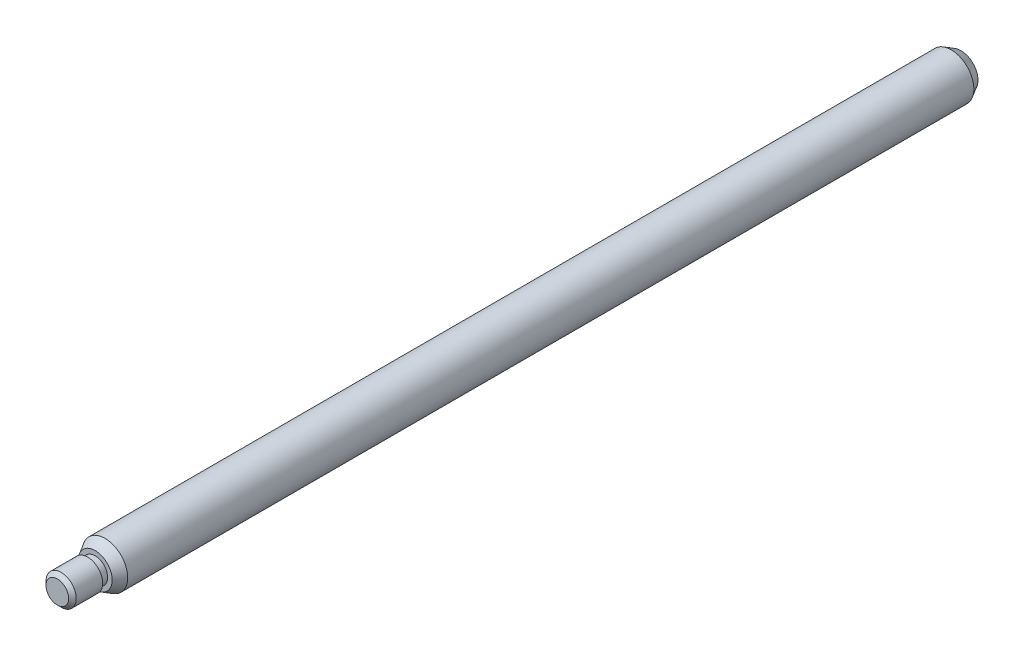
ISO-10303-21;
HEADER;
FILE_DESCRIPTION(('STEP AP214'),'2;1');
FILE_NAME('part.step','',(''),(''),'','','');
FILE_SCHEMA(('AUTOMOTIVE_DESIGN { 1 0 10303 214 1 1 1 1 }'));
ENDSEC;
DATA;
#1=APPLICATION_CONTEXT('core data for automotive mechanical design processes');
#2=APPLICATION_PROTOCOL_DEFINITION('international standard','automotive_design',2000,#1);
#3=PRODUCT_CONTEXT('',#1,'mechanical');
#4=PRODUCT('Part','Part','',(#3));
#5=PRODUCT_RELATED_PRODUCT_CATEGORY('part','',(#4));
#6=PRODUCT_DEFINITION_FORMATION('','',#4);
#7=PRODUCT_DEFINITION_CONTEXT('part definition',#1,'design');
#8=PRODUCT_DEFINITION('design','',#6,#7);
#9=PRODUCT_DEFINITION_SHAPE('','',#8);
#10=(LENGTH_UNIT() NAMED_UNIT(*) SI_UNIT(.MILLI.,.METRE.));
#11=(NAMED_UNIT(*) PLANE_ANGLE_UNIT() SI_UNIT($,.RADIAN.));
#12=(NAMED_UNIT(*) SI_UNIT($,.STERADIAN.) SOLID_ANGLE_UNIT());
#13=UNCERTAINTY_MEASURE_WITH_UNIT(LENGTH_MEASURE(1.E-05),#10,'distance_accuracy_value','');
#14=(GEOMETRIC_REPRESENTATION_CONTEXT(3) GLOBAL_UNCERTAINTY_ASSIGNED_CONTEXT((#13)) GLOBAL_UNIT_ASSIGNED_CONTEXT((#10,
#11,#12)) REPRESENTATION_CONTEXT('',''));
#15=CARTESIAN_POINT('',(0.,0.,0.));
#16=DIRECTION('',(0.,0.,1.));
#17=DIRECTION('',(1.,0.,0.));
#18=AXIS2_PLACEMENT_3D('',#15,#16,#17);
#19=CARTESIAN_POINT('',(0.,0.,114.5));
#20=DIRECTION('',(0.,0.,1.));
#21=DIRECTION('',(1.,0.,0.));
#22=AXIS2_PLACEMENT_3D('',#19,#20,#21);
#23=PLANE('',#22);
#24=CARTESIAN_POINT('',(0.,0.,114.5));
#25=DIRECTION('',(0.,0.,1.));
#26=DIRECTION('',(1.,0.,0.));
#27=AXIS2_PLACEMENT_3D('',#24,#25,#26);
#28=CIRCLE('',#27,2.24944465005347);
#29=CARTESIAN_POINT('',(-2.24944465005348,0.,114.5));
#30=VERTEX_POINT('',#29);
#31=EDGE_CURVE('E53',#30,#30,#28,.T.);
#32=ORIENTED_EDGE('',*,*,#31,.T.);
#33=EDGE_LOOP('',(#32));
#34=FACE_BOUND('',#33,.T.);
#35=CARTESIAN_POINT('',(0.,0.,114.5));
#36=DIRECTION('',(0.,0.,1.));
#37=DIRECTION('',(1.,0.,0.));
#38=AXIS2_PLACEMENT_3D('',#35,#36,#37);
#39=CIRCLE('',#38,1.65);
#40=CARTESIAN_POINT('',(-1.65,0.,114.5));
#41=VERTEX_POINT('',#40);
#42=EDGE_CURVE('E59',#41,#41,#39,.T.);
#43=ORIENTED_EDGE('',*,*,#42,.F.);
#44=EDGE_LOOP('',(#43));
#45=FACE_BOUND('',#44,.T.);
#46=ADVANCED_FACE('F30',(#34,#45),#23,.T.);
#47=CARTESIAN_POINT('',(0.,0.,114.5));
#48=DIRECTION('',(0.,0.,-1.));
#49=DIRECTION('',(-1.,0.,0.));
#50=AXIS2_PLACEMENT_3D('',#47,#48,#49);
#51=CYLINDRICAL_SURFACE('',#50,3.);
#52=CARTESIAN_POINT('',(0.,0.,113.2));
#53=DIRECTION('',(0.,0.,1.));
#54=DIRECTION('',(1.,0.,0.));
#55=AXIS2_PLACEMENT_3D('',#52,#53,#54);
#56=CIRCLE('',#55,3.);
#57=CARTESIAN_POINT('',(-3.,0.,113.2));
#58=VERTEX_POINT('',#57);
#59=EDGE_CURVE('E47',#58,#58,#56,.F.);
#60=CARTESIAN_POINT('',(0.,0.,1.30000000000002));
#61=DIRECTION('',(0.,0.,1.));
#62=DIRECTION('',(1.,0.,0.));
#63=AXIS2_PLACEMENT_3D('',#60,#61,#62);
#64=CIRCLE('',#63,3.);
#65=CARTESIAN_POINT('',(-3.,0.,1.30000000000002));
#66=VERTEX_POINT('',#65);
#67=EDGE_CURVE('E50',#66,#66,#64,.T.);
#68=CARTESIAN_POINT('',(-3.,0.,113.2));
#69=CARTESIAN_POINT('',(-3.,0.,112.034375));
#70=CARTESIAN_POINT('',(-3.,0.,110.86875));
#71=CARTESIAN_POINT('',(-3.,0.,108.5375));
#72=CARTESIAN_POINT('',(-3.,0.,107.371875));
#73=CARTESIAN_POINT('',(-3.,0.,105.040625));
#74=CARTESIAN_POINT('',(-3.,0.,103.875));
#75=CARTESIAN_POINT('',(-3.,0.,101.54375));
#76=CARTESIAN_POINT('',(-3.,0.,100.378125));
#77=CARTESIAN_POINT('',(-3.,0.,98.0468749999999));
#78=CARTESIAN_POINT('',(-3.,0.,96.8812499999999));
#79=CARTESIAN_POINT('',(-3.,0.,94.5499999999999));
#80=CARTESIAN_POINT('',(-3.,0.,93.3843749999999));
#81=CARTESIAN_POINT('',(-3.,0.,91.0531249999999));
#82=CARTESIAN_POINT('',(-3.,0.,89.8874999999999));
#83=CARTESIAN_POINT('',(-3.,0.,87.5562499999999));
#84=CARTESIAN_POINT('',(-3.,0.,86.3906249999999));
#85=CARTESIAN_POINT('',(-3.,0.,84.0593749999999));
#86=CARTESIAN_POINT('',(-3.,0.,82.8937499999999));
#87=CARTESIAN_POINT('',(-3.,0.,80.5624999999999));
#88=CARTESIAN_POINT('',(-3.,0.,79.3968749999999));
#89=CARTESIAN_POINT('',(-3.,0.,77.0656249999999));
#90=CARTESIAN_POINT('',(-3.,0.,75.8999999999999));
#91=CARTESIAN_POINT('',(-3.,0.,73.56875));
#92=CARTESIAN_POINT('',(-3.,0.,72.403125));
#93=CARTESIAN_POINT('',(-3.,0.,70.0718749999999));
#94=CARTESIAN_POINT('',(-3.,0.,68.90625));
#95=CARTESIAN_POINT('',(-3.,0.,66.575));
#96=CARTESIAN_POINT('',(-3.,0.,65.409375));
#97=CARTESIAN_POINT('',(-3.,0.,63.078125));
#98=CARTESIAN_POINT('',(-3.,0.,61.9125));
#99=CARTESIAN_POINT('',(-3.,0.,59.58125));
#100=CARTESIAN_POINT('',(-3.,0.,58.415625));
#101=CARTESIAN_POINT('',(-3.,0.,56.084375));
#102=CARTESIAN_POINT('',(-3.,0.,54.91875));
#103=CARTESIAN_POINT('',(-3.,0.,52.5875));
#104=CARTESIAN_POINT('',(-3.,0.,51.421875));
#105=CARTESIAN_POINT('',(-3.,0.,49.090625));
#106=CARTESIAN_POINT('',(-3.,0.,47.925));
#107=CARTESIAN_POINT('',(-3.,0.,45.59375));
#108=CARTESIAN_POINT('',(-3.,0.,44.428125));
#109=CARTESIAN_POINT('',(-3.,0.,42.096875));
#110=CARTESIAN_POINT('',(-3.,0.,40.93125));
#111=CARTESIAN_POINT('',(-3.,0.,38.6));
#112=CARTESIAN_POINT('',(-3.,0.,37.434375));
#113=CARTESIAN_POINT('',(-3.,0.,35.103125));
#114=CARTESIAN_POINT('',(-3.,0.,33.9375));
#115=CARTESIAN_POINT('',(-3.,0.,31.60625));
#116=CARTESIAN_POINT('',(-3.,0.,30.440625));
#117=CARTESIAN_POINT('',(-3.,0.,28.109375));
#118=CARTESIAN_POINT('',(-3.,0.,26.94375));
#119=CARTESIAN_POINT('',(-3.,0.,24.6125));
#120=CARTESIAN_POINT('',(-3.,0.,23.446875));
#121=CARTESIAN_POINT('',(-3.,0.,21.115625));
#122=CARTESIAN_POINT('',(-3.,0.,19.95));
#123=CARTESIAN_POINT('',(-3.,0.,17.61875));
#124=CARTESIAN_POINT('',(-3.,0.,16.453125));
#125=CARTESIAN_POINT('',(-3.,0.,14.121875));
#126=CARTESIAN_POINT('',(-3.,0.,12.95625));
#127=CARTESIAN_POINT('',(-3.,0.,10.625));
#128=CARTESIAN_POINT('',(-3.,0.,9.459375));
#129=CARTESIAN_POINT('',(-3.,0.,7.12812500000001));
#130=CARTESIAN_POINT('',(-3.,0.,5.96250000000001));
#131=CARTESIAN_POINT('',(-3.,0.,3.63125000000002));
#132=CARTESIAN_POINT('',(-3.,0.,2.46562500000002));
#133=CARTESIAN_POINT('',(-3.,0.,1.30000000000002));
#134=B_SPLINE_CURVE_WITH_KNOTS('',3,(#68,#69,#70,#71,#72,#73,#74,#75,#76,#77,#78,#79,#80,#81,
#82,#83,#84,#85,#86,#87,#88,#89,#90,#91,#92,#93,#94,#95,#96,#97,#98,#99,#100,#101,#102,#103,
#104,#105,#106,#107,#108,#109,#110,#111,#112,#113,#114,#115,#116,#117,#118,#119,#120,#121,#122,
#123,#124,#125,#126,#127,#128,#129,#130,#131,#132,#133),.UNSPECIFIED.,.F.,.F.,(4,2,2,2,2,2,2,2,
2,2,2,2,2,2,2,2,2,2,2,2,2,2,2,2,2,2,2,2,2,2,2,2,4),(0.,3.496875,6.99374999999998,10.490625,
13.9875,17.484375,20.98125,24.478125,27.975,31.471875,34.96875,38.4656249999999,
41.9624999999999,45.4593749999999,48.9562499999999,52.4531249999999,55.9499999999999,
59.4468749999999,62.9437499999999,66.4406249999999,69.9374999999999,73.4343749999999,
76.9312499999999,80.4281249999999,83.9249999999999,87.4218749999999,90.9187499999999,
94.4156249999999,97.9124999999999,101.409375,104.90625,108.403125,111.9),.UNSPECIFIED.);
#135=EDGE_CURVE('BSEAM32',#58,#66,#134,.T.);
#136=ORIENTED_EDGE('',*,*,#59,.T.);
#137=ORIENTED_EDGE('',*,*,#67,.T.);
#138=ORIENTED_EDGE('',*,*,#135,.T.);
#139=ORIENTED_EDGE('',*,*,#135,.F.);
#140=EDGE_LOOP('',(#136,#138,#137,#139));
#141=FACE_BOUND('',#140,.T.);
#142=ADVANCED_FACE('F32',(#141),#51,.T.);
#143=CARTESIAN_POINT('',(0.,0.,0.));
#144=DIRECTION('',(0.,0.,1.));
#145=DIRECTION('',(1.,0.,0.));
#146=AXIS2_PLACEMENT_3D('',#143,#144,#145);
#147=PLANE('',#146);
#148=CARTESIAN_POINT('',(0.,0.,0.));
#149=DIRECTION('',(0.,0.,1.));
#150=DIRECTION('',(1.,0.,0.));
#151=AXIS2_PLACEMENT_3D('',#148,#149,#150);
#152=CIRCLE('',#151,2.24944465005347);
#153=CARTESIAN_POINT('',(2.24944465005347,0.,0.));
#154=VERTEX_POINT('',#153);
#155=EDGE_CURVE('E42',#154,#154,#152,.F.);
#156=ORIENTED_EDGE('',*,*,#155,.T.);
#157=EDGE_LOOP('',(#156));
#158=FACE_BOUND('',#157,.T.);
#159=ADVANCED_FACE('F70',(#158),#147,.F.);
#160=CARTESIAN_POINT('',(0.,0.,114.5));
#161=DIRECTION('',(0.,0.,-1.));
#162=DIRECTION('',(-1.,0.,0.));
#163=AXIS2_PLACEMENT_3D('',#160,#161,#162);
#164=CONICAL_SURFACE('',#163,2.24944465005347,0.523598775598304);
#165=CARTESIAN_POINT('',(-3.00000000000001,0.,113.2));
#166=CARTESIAN_POINT('',(-2.99218171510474,0.,113.213541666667));
#167=CARTESIAN_POINT('',(-2.98436343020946,0.,113.227083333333));
#168=CARTESIAN_POINT('',(-2.96872686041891,0.,113.254166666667));
#169=CARTESIAN_POINT('',(-2.96090857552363,0.,113.267708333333));
#170=CARTESIAN_POINT('',(-2.94527200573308,0.,113.294791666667));
#171=CARTESIAN_POINT('',(-2.9374537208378,0.,113.308333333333));
#172=CARTESIAN_POINT('',(-2.92181715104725,0.,113.335416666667));
#173=CARTESIAN_POINT('',(-2.91399886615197,0.,113.348958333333));
#174=CARTESIAN_POINT('',(-2.89836229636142,0.,113.376041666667));
#175=CARTESIAN_POINT('',(-2.89054401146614,0.,113.389583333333));
#176=CARTESIAN_POINT('',(-2.87490744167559,0.,113.416666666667));
#177=CARTESIAN_POINT('',(-2.86708915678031,0.,113.430208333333));
#178=CARTESIAN_POINT('',(-2.85145258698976,0.,113.457291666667));
#179=CARTESIAN_POINT('',(-2.84363430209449,0.,113.470833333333));
#180=CARTESIAN_POINT('',(-2.82799773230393,0.,113.497916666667));
#181=CARTESIAN_POINT('',(-2.82017944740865,0.,113.511458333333));
#182=CARTESIAN_POINT('',(-2.8045428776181,0.,113.538541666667));
#183=CARTESIAN_POINT('',(-2.79672459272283,0.,113.552083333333));
#184=CARTESIAN_POINT('',(-2.78108802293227,0.,113.579166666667));
#185=CARTESIAN_POINT('',(-2.773269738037,0.,113.592708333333));
#186=CARTESIAN_POINT('',(-2.75763316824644,0.,113.619791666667));
#187=CARTESIAN_POINT('',(-2.74981488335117,0.,113.633333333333));
#188=CARTESIAN_POINT('',(-2.73417831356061,0.,113.660416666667));
#189=CARTESIAN_POINT('',(-2.72636002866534,0.,113.673958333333));
#190=CARTESIAN_POINT('',(-2.71072345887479,0.,113.701041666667));
#191=CARTESIAN_POINT('',(-2.70290517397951,0.,113.714583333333));
#192=CARTESIAN_POINT('',(-2.68726860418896,0.,113.741666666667));
#193=CARTESIAN_POINT('',(-2.67945031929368,0.,113.755208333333));
#194=CARTESIAN_POINT('',(-2.66381374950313,0.,113.782291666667));
#195=CARTESIAN_POINT('',(-2.65599546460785,0.,113.795833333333));
#196=CARTESIAN_POINT('',(-2.6403588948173,0.,113.822916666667));
#197=CARTESIAN_POINT('',(-2.63254060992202,0.,113.836458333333));
#198=CARTESIAN_POINT('',(-2.61690404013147,0.,113.863541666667));
#199=CARTESIAN_POINT('',(-2.60908575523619,0.,113.877083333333));
#200=CARTESIAN_POINT('',(-2.59344918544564,0.,113.904166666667));
#201=CARTESIAN_POINT('',(-2.58563090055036,0.,113.917708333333));
#202=CARTESIAN_POINT('',(-2.56999433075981,0.,113.944791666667));
#203=CARTESIAN_POINT('',(-2.56217604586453,0.,113.958333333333));
#204=CARTESIAN_POINT('',(-2.54653947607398,0.,113.985416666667));
#205=CARTESIAN_POINT('',(-2.5387211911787,0.,113.998958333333));
#206=CARTESIAN_POINT('',(-2.52308462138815,0.,114.026041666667));
#207=CARTESIAN_POINT('',(-2.51526633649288,0.,114.039583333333));
#208=CARTESIAN_POINT('',(-2.49962976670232,0.,114.066666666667));
#209=CARTESIAN_POINT('',(-2.49181148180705,0.,114.080208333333));
#210=CARTESIAN_POINT('',(-2.47617491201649,0.,114.107291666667));
#211=CARTESIAN_POINT('',(-2.46835662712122,0.,114.120833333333));
#212=CARTESIAN_POINT('',(-2.45272005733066,0.,114.147916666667));
#213=CARTESIAN_POINT('',(-2.44490177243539,0.,114.161458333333));
#214=CARTESIAN_POINT('',(-2.42926520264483,0.,114.188541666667));
#215=CARTESIAN_POINT('',(-2.42144691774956,0.,114.202083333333));
#216=CARTESIAN_POINT('',(-2.40581034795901,0.,114.229166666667));
#217=CARTESIAN_POINT('',(-2.39799206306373,0.,114.242708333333));
#218=CARTESIAN_POINT('',(-2.38235549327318,0.,114.269791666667));
#219=CARTESIAN_POINT('',(-2.3745372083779,0.,114.283333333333));
#220=CARTESIAN_POINT('',(-2.35890063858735,0.,114.310416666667));
#221=CARTESIAN_POINT('',(-2.35108235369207,0.,114.323958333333));
#222=CARTESIAN_POINT('',(-2.33544578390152,0.,114.351041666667));
#223=CARTESIAN_POINT('',(-2.32762749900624,0.,114.364583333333));
#224=CARTESIAN_POINT('',(-2.31199092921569,0.,114.391666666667));
#225=CARTESIAN_POINT('',(-2.30417264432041,0.,114.405208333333));
#226=CARTESIAN_POINT('',(-2.28853607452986,0.,114.432291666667));
#227=CARTESIAN_POINT('',(-2.28071778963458,0.,114.445833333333));
#228=CARTESIAN_POINT('',(-2.26508121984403,0.,114.472916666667));
#229=CARTESIAN_POINT('',(-2.25726293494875,0.,114.486458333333));
#230=CARTESIAN_POINT('',(-2.24944465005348,0.,114.5));
#231=B_SPLINE_CURVE_WITH_KNOTS('',3,(#165,#166,#167,#168,#169,#170,#171,#172,#173,#174,#175,
#176,#177,#178,#179,#180,#181,#182,#183,#184,#185,#186,#187,#188,#189,#190,#191,#192,#193,#194,
#195,#196,#197,#198,#199,#200,#201,#202,#203,#204,#205,#206,#207,#208,#209,#210,#211,#212,#213,
#214,#215,#216,#217,#218,#219,#220,#221,#222,#223,#224,#225,#226,#227,#228,#229,#230),
.UNSPECIFIED.,.F.,.F.,(4,2,2,2,2,2,2,2,2,2,2,2,2,2,2,2,2,2,2,2,2,2,2,2,2,2,2,2,2,2,2,2,4),(0.,
0.0469097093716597,0.0938194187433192,0.140729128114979,0.187638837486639,0.234548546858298,
0.281458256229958,0.328367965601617,0.375277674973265,0.422187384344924,0.469097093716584,
0.516006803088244,0.562916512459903,0.609826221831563,0.656735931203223,0.703645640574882,
0.75055534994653,0.797465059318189,0.844374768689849,0.891284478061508,0.938194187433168,
0.985103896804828,1.03201360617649,1.07892331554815,1.12583302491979,1.17274273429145,
1.21965244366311,1.26656215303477,1.31347186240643,1.36038157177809,1.40729128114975,
1.45420099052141,1.50111069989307),.UNSPECIFIED.);
#232=EDGE_CURVE('BSEAM75',#58,#30,#231,.T.);
#233=ORIENTED_EDGE('',*,*,#59,.F.);
#234=ORIENTED_EDGE('',*,*,#31,.F.);
#235=ORIENTED_EDGE('',*,*,#232,.T.);
#236=ORIENTED_EDGE('',*,*,#232,.F.);
#237=EDGE_LOOP('',(#233,#235,#234,#236));
#238=FACE_BOUND('',#237,.T.);
#239=ADVANCED_FACE('F75',(#238),#164,.T.);
#240=CARTESIAN_POINT('',(0.,0.,1.30000000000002));
#241=DIRECTION('',(0.,0.,1.));
#242=DIRECTION('',(1.,0.,0.));
#243=AXIS2_PLACEMENT_3D('',#240,#241,#242);
#244=CONICAL_SURFACE('',#243,3.,0.523598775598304);
#245=ORIENTED_EDGE('',*,*,#155,.F.);
#246=EDGE_LOOP('',(#245));
#247=FACE_BOUND('',#246,.T.);
#248=ORIENTED_EDGE('',*,*,#67,.F.);
#249=EDGE_LOOP('',(#248));
#250=FACE_BOUND('',#249,.T.);
#251=ADVANCED_FACE('F79',(#247,#250),#244,.T.);
#252=CARTESIAN_POINT('',(0.,0.,115.5));
#253=DIRECTION('',(0.,0.,1.));
#254=DIRECTION('',(1.,0.,0.));
#255=AXIS2_PLACEMENT_3D('',#252,#253,#254);
#256=PLANE('',#255);
#257=CARTESIAN_POINT('',(0.,0.,115.5));
#258=DIRECTION('',(0.,0.,1.));
#259=DIRECTION('',(1.,0.,0.));
#260=AXIS2_PLACEMENT_3D('',#257,#258,#259);
#261=CIRCLE('',#260,1.99999999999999);
#262=CARTESIAN_POINT('',(-1.99999999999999,0.,115.5));
#263=VERTEX_POINT('',#262);
#264=EDGE_CURVE('E34',#263,#263,#261,.F.);
#265=ORIENTED_EDGE('',*,*,#264,.T.);
#266=EDGE_LOOP('',(#265));
#267=FACE_BOUND('',#266,.T.);
#268=CARTESIAN_POINT('',(0.,0.,115.5));
#269=DIRECTION('',(0.,0.,1.));
#270=DIRECTION('',(1.,0.,0.));
#271=AXIS2_PLACEMENT_3D('',#268,#269,#270);
#272=CIRCLE('',#271,1.65);
#273=CARTESIAN_POINT('',(-1.65,0.,115.5));
#274=VERTEX_POINT('',#273);
#275=EDGE_CURVE('E56',#274,#274,#272,.T.);
#276=ORIENTED_EDGE('',*,*,#275,.T.);
#277=EDGE_LOOP('',(#276));
#278=FACE_BOUND('',#277,.T.);
#279=ADVANCED_FACE('F83',(#267,#278),#256,.F.);
#280=CARTESIAN_POINT('',(0.,0.,115.5));
#281=DIRECTION('',(0.,0.,-1.));
#282=DIRECTION('',(-1.,0.,0.));
#283=AXIS2_PLACEMENT_3D('',#280,#281,#282);
#284=CYLINDRICAL_SURFACE('',#283,1.65);
#285=CARTESIAN_POINT('',(-1.65,0.,115.5));
#286=CARTESIAN_POINT('',(-1.65,0.,115.489583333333));
#287=CARTESIAN_POINT('',(-1.65,0.,115.479166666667));
#288=CARTESIAN_POINT('',(-1.65,0.,115.458333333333));
#289=CARTESIAN_POINT('',(-1.65,0.,115.447916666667));
#290=CARTESIAN_POINT('',(-1.65,0.,115.427083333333));
#291=CARTESIAN_POINT('',(-1.65,0.,115.416666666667));
#292=CARTESIAN_POINT('',(-1.65,0.,115.395833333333));
#293=CARTESIAN_POINT('',(-1.65,0.,115.385416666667));
#294=CARTESIAN_POINT('',(-1.65,0.,115.364583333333));
#295=CARTESIAN_POINT('',(-1.65,0.,115.354166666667));
#296=CARTESIAN_POINT('',(-1.65,0.,115.333333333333));
#297=CARTESIAN_POINT('',(-1.65,0.,115.322916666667));
#298=CARTESIAN_POINT('',(-1.65,0.,115.302083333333));
#299=CARTESIAN_POINT('',(-1.65,0.,115.291666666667));
#300=CARTESIAN_POINT('',(-1.65,0.,115.270833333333));
#301=CARTESIAN_POINT('',(-1.65,0.,115.260416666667));
#302=CARTESIAN_POINT('',(-1.65,0.,115.239583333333));
#303=CARTESIAN_POINT('',(-1.65,0.,115.229166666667));
#304=CARTESIAN_POINT('',(-1.65,0.,115.208333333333));
#305=CARTESIAN_POINT('',(-1.65,0.,115.197916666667));
#306=CARTESIAN_POINT('',(-1.65,0.,115.177083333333));
#307=CARTESIAN_POINT('',(-1.65,0.,115.166666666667));
#308=CARTESIAN_POINT('',(-1.65,0.,115.145833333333));
#309=CARTESIAN_POINT('',(-1.65,0.,115.135416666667));
#310=CARTESIAN_POINT('',(-1.65,0.,115.114583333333));
#311=CARTESIAN_POINT('',(-1.65,0.,115.104166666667));
#312=CARTESIAN_POINT('',(-1.65,0.,115.083333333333));
#313=CARTESIAN_POINT('',(-1.65,0.,115.072916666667));
#314=CARTESIAN_POINT('',(-1.65,0.,115.052083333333));
#315=CARTESIAN_POINT('',(-1.65,0.,115.041666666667));
#316=CARTESIAN_POINT('',(-1.65,0.,115.020833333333));
#317=CARTESIAN_POINT('',(-1.65,0.,115.010416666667));
#318=CARTESIAN_POINT('',(-1.65,0.,114.989583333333));
#319=CARTESIAN_POINT('',(-1.65,0.,114.979166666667));
#320=CARTESIAN_POINT('',(-1.65,0.,114.958333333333));
#321=CARTESIAN_POINT('',(-1.65,0.,114.947916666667));
#322=CARTESIAN_POINT('',(-1.65,0.,114.927083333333));
#323=CARTESIAN_POINT('',(-1.65,0.,114.916666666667));
#324=CARTESIAN_POINT('',(-1.65,0.,114.895833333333));
#325=CARTESIAN_POINT('',(-1.65,0.,114.885416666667));
#326=CARTESIAN_POINT('',(-1.65,0.,114.864583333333));
#327=CARTESIAN_POINT('',(-1.65,0.,114.854166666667));
#328=CARTESIAN_POINT('',(-1.65,0.,114.833333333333));
#329=CARTESIAN_POINT('',(-1.65,0.,114.822916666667));
#330=CARTESIAN_POINT('',(-1.65,0.,114.802083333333));
#331=CARTESIAN_POINT('',(-1.65,0.,114.791666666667));
#332=CARTESIAN_POINT('',(-1.65,0.,114.770833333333));
#333=CARTESIAN_POINT('',(-1.65,0.,114.760416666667));
#334=CARTESIAN_POINT('',(-1.65,0.,114.739583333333));
#335=CARTESIAN_POINT('',(-1.65,0.,114.729166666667));
#336=CARTESIAN_POINT('',(-1.65,0.,114.708333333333));
#337=CARTESIAN_POINT('',(-1.65,0.,114.697916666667));
#338=CARTESIAN_POINT('',(-1.65,0.,114.677083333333));
#339=CARTESIAN_POINT('',(-1.65,0.,114.666666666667));
#340=CARTESIAN_POINT('',(-1.65,0.,114.645833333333));
#341=CARTESIAN_POINT('',(-1.65,0.,114.635416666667));
#342=CARTESIAN_POINT('',(-1.65,0.,114.614583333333));
#343=CARTESIAN_POINT('',(-1.65,0.,114.604166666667));
#344=CARTESIAN_POINT('',(-1.65,0.,114.583333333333));
#345=CARTESIAN_POINT('',(-1.65,0.,114.572916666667));
#346=CARTESIAN_POINT('',(-1.65,0.,114.552083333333));
#347=CARTESIAN_POINT('',(-1.65,0.,114.541666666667));
#348=CARTESIAN_POINT('',(-1.65,0.,114.520833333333));
#349=CARTESIAN_POINT('',(-1.65,0.,114.510416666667));
#350=CARTESIAN_POINT('',(-1.65,0.,114.5));
#351=B_SPLINE_CURVE_WITH_KNOTS('',3,(#285,#286,#287,#288,#289,#290,#291,#292,#293,#294,#295,
#296,#297,#298,#299,#300,#301,#302,#303,#304,#305,#306,#307,#308,#309,#310,#311,#312,#313,#314,
#315,#316,#317,#318,#319,#320,#321,#322,#323,#324,#325,#326,#327,#328,#329,#330,#331,#332,#333,
#334,#335,#336,#337,#338,#339,#340,#341,#342,#343,#344,#345,#346,#347,#348,#349,#350),
.UNSPECIFIED.,.F.,.F.,(4,2,2,2,2,2,2,2,2,2,2,2,2,2,2,2,2,2,2,2,2,2,2,2,2,2,2,2,2,2,2,2,4),(0.,
0.0312499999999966,0.0624999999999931,0.0937499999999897,0.125,0.156249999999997,
0.187499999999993,0.21874999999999,0.249999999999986,0.281249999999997,0.312499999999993,
0.34374999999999,0.375,0.406249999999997,0.437499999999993,0.46874999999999,0.499999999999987,
0.531249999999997,0.562499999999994,0.59374999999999,0.624999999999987,0.656249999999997,
0.687499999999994,0.71874999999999,0.749999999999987,0.781249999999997,0.812499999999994,
0.84374999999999,0.875000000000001,0.906249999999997,0.937499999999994,0.96874999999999,
0.999999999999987),.UNSPECIFIED.);
#352=EDGE_CURVE('BSEAM63',#274,#41,#351,.T.);
#353=ORIENTED_EDGE('',*,*,#275,.F.);
#354=ORIENTED_EDGE('',*,*,#42,.T.);
#355=ORIENTED_EDGE('',*,*,#352,.T.);
#356=ORIENTED_EDGE('',*,*,#352,.F.);
#357=EDGE_LOOP('',(#353,#355,#354,#356));
#358=FACE_BOUND('',#357,.T.);
#359=ADVANCED_FACE('F63',(#358),#284,.T.);
#360=CARTESIAN_POINT('',(-2.00000000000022,1.11022302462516E-13,119.5));
#361=DIRECTION('',(0.,0.,1.));
#362=DIRECTION('',(1.,0.,0.));
#363=AXIS2_PLACEMENT_3D('',#360,#361,#362);
#364=PLANE('',#363);
#365=CARTESIAN_POINT('',(0.,0.,119.5));
#366=DIRECTION('',(0.,0.,1.));
#367=DIRECTION('',(1.,0.,0.));
#368=AXIS2_PLACEMENT_3D('',#365,#366,#367);
#369=CIRCLE('',#368,1.49999999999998);
#370=CARTESIAN_POINT('',(-1.5,0.,119.5));
#371=VERTEX_POINT('',#370);
#372=EDGE_CURVE('E10',#371,#371,#369,.T.);
#373=ORIENTED_EDGE('',*,*,#372,.T.);
#374=EDGE_LOOP('',(#373));
#375=FACE_BOUND('',#374,.T.);
#376=ADVANCED_FACE('F90',(#375),#364,.T.);
#377=CARTESIAN_POINT('',(0.,0.,119.));
#378=DIRECTION('',(0.,0.,-1.));
#379=DIRECTION('',(-1.,0.,0.));
#380=AXIS2_PLACEMENT_3D('',#377,#378,#379);
#381=CONICAL_SURFACE('',#380,1.99999999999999,0.785398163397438);
#382=CARTESIAN_POINT('',(0.,0.,119.));
#383=DIRECTION('',(0.,0.,1.));
#384=DIRECTION('',(1.,0.,0.));
#385=AXIS2_PLACEMENT_3D('',#382,#383,#384);
#386=CIRCLE('',#385,1.99999999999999);
#387=CARTESIAN_POINT('',(-1.99999999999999,0.,119.));
#388=VERTEX_POINT('',#387);
#389=EDGE_CURVE('E38',#388,#388,#386,.F.);
#390=CARTESIAN_POINT('',(-1.5,0.,119.5));
#391=CARTESIAN_POINT('',(-1.50520833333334,0.,119.494791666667));
#392=CARTESIAN_POINT('',(-1.51041666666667,0.,119.489583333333));
#393=CARTESIAN_POINT('',(-1.52083333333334,0.,119.479166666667));
#394=CARTESIAN_POINT('',(-1.52604166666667,0.,119.473958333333));
#395=CARTESIAN_POINT('',(-1.53645833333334,0.,119.463541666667));
#396=CARTESIAN_POINT('',(-1.54166666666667,0.,119.458333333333));
#397=CARTESIAN_POINT('',(-1.55208333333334,0.,119.447916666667));
#398=CARTESIAN_POINT('',(-1.55729166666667,0.,119.442708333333));
#399=CARTESIAN_POINT('',(-1.56770833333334,0.,119.432291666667));
#400=CARTESIAN_POINT('',(-1.57291666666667,0.,119.427083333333));
#401=CARTESIAN_POINT('',(-1.58333333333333,0.,119.416666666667));
#402=CARTESIAN_POINT('',(-1.58854166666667,0.,119.411458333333));
#403=CARTESIAN_POINT('',(-1.59895833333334,0.,119.401041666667));
#404=CARTESIAN_POINT('',(-1.60416666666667,0.,119.395833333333));
#405=CARTESIAN_POINT('',(-1.61458333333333,0.,119.385416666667));
#406=CARTESIAN_POINT('',(-1.61979166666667,0.,119.380208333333));
#407=CARTESIAN_POINT('',(-1.63020833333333,0.,119.369791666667));
#408=CARTESIAN_POINT('',(-1.63541666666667,0.,119.364583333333));
#409=CARTESIAN_POINT('',(-1.64583333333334,0.,119.354166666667));
#410=CARTESIAN_POINT('',(-1.65104166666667,0.,119.348958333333));
#411=CARTESIAN_POINT('',(-1.66145833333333,0.,119.338541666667));
#412=CARTESIAN_POINT('',(-1.66666666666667,0.,119.333333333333));
#413=CARTESIAN_POINT('',(-1.67708333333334,0.,119.322916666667));
#414=CARTESIAN_POINT('',(-1.68229166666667,0.,119.317708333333));
#415=CARTESIAN_POINT('',(-1.69270833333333,0.,119.307291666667));
#416=CARTESIAN_POINT('',(-1.69791666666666,0.,119.302083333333));
#417=CARTESIAN_POINT('',(-1.70833333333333,0.,119.291666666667));
#418=CARTESIAN_POINT('',(-1.71354166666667,0.,119.286458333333));
#419=CARTESIAN_POINT('',(-1.72395833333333,0.,119.276041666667));
#420=CARTESIAN_POINT('',(-1.72916666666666,0.,119.270833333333));
#421=CARTESIAN_POINT('',(-1.73958333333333,0.,119.260416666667));
#422=CARTESIAN_POINT('',(-1.74479166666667,0.,119.255208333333));
#423=CARTESIAN_POINT('',(-1.75520833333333,0.,119.244791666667));
#424=CARTESIAN_POINT('',(-1.76041666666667,0.,119.239583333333));
#425=CARTESIAN_POINT('',(-1.77083333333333,0.,119.229166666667));
#426=CARTESIAN_POINT('',(-1.77604166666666,0.,119.223958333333));
#427=CARTESIAN_POINT('',(-1.78645833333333,0.,119.213541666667));
#428=CARTESIAN_POINT('',(-1.79166666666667,0.,119.208333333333));
#429=CARTESIAN_POINT('',(-1.80208333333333,0.,119.197916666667));
#430=CARTESIAN_POINT('',(-1.80729166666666,0.,119.192708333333));
#431=CARTESIAN_POINT('',(-1.81770833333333,0.,119.182291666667));
#432=CARTESIAN_POINT('',(-1.82291666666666,0.,119.177083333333));
#433=CARTESIAN_POINT('',(-1.83333333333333,0.,119.166666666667));
#434=CARTESIAN_POINT('',(-1.83854166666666,0.,119.161458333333));
#435=CARTESIAN_POINT('',(-1.84895833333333,0.,119.151041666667));
#436=CARTESIAN_POINT('',(-1.85416666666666,0.,119.145833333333));
#437=CARTESIAN_POINT('',(-1.86458333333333,0.,119.135416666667));
#438=CARTESIAN_POINT('',(-1.86979166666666,0.,119.130208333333));
#439=CARTESIAN_POINT('',(-1.88020833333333,0.,119.119791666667));
#440=CARTESIAN_POINT('',(-1.88541666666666,0.,119.114583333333));
#441=CARTESIAN_POINT('',(-1.89583333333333,0.,119.104166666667));
#442=CARTESIAN_POINT('',(-1.90104166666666,0.,119.098958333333));
#443=CARTESIAN_POINT('',(-1.91145833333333,0.,119.088541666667));
#444=CARTESIAN_POINT('',(-1.91666666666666,0.,119.083333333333));
#445=CARTESIAN_POINT('',(-1.92708333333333,0.,119.072916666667));
#446=CARTESIAN_POINT('',(-1.93229166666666,0.,119.067708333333));
#447=CARTESIAN_POINT('',(-1.94270833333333,0.,119.057291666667));
#448=CARTESIAN_POINT('',(-1.94791666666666,0.,119.052083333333));
#449=CARTESIAN_POINT('',(-1.95833333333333,0.,119.041666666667));
#450=CARTESIAN_POINT('',(-1.96354166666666,0.,119.036458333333));
#451=CARTESIAN_POINT('',(-1.97395833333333,0.,119.026041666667));
#452=CARTESIAN_POINT('',(-1.97916666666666,0.,119.020833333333));
#453=CARTESIAN_POINT('',(-1.98958333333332,0.,119.010416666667));
#454=CARTESIAN_POINT('',(-1.99479166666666,0.,119.005208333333));
#455=CARTESIAN_POINT('',(-1.99999999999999,0.,119.));
#456=B_SPLINE_CURVE_WITH_KNOTS('',3,(#390,#391,#392,#393,#394,#395,#396,#397,#398,#399,#400,
#401,#402,#403,#404,#405,#406,#407,#408,#409,#410,#411,#412,#413,#414,#415,#416,#417,#418,#419,
#420,#421,#422,#423,#424,#425,#426,#427,#428,#429,#430,#431,#432,#433,#434,#435,#436,#437,#438,
#439,#440,#441,#442,#443,#444,#445,#446,#447,#448,#449,#450,#451,#452,#453,#454,#455),
.UNSPECIFIED.,.F.,.F.,(4,2,2,2,2,2,2,2,2,2,2,2,2,2,2,2,2,2,2,2,2,2,2,2,2,2,2,2,2,2,2,2,4),(0.,
0.022097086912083,0.0441941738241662,0.0662912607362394,0.0883883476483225,0.110485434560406,
0.132582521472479,0.154679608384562,0.176776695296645,0.198873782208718,0.220970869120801,
0.243067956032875,0.265165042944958,0.287262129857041,0.309359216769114,0.331456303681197,
0.35355339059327,0.375650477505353,0.397747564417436,0.41984465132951,0.441941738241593,
0.464038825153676,0.486135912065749,0.508232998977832,0.530330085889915,0.552427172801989,
0.574524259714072,0.596621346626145,0.618718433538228,0.640815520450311,0.662912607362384,
0.685009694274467,0.707106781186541),.UNSPECIFIED.);
#457=EDGE_CURVE('BSEAM88',#371,#388,#456,.T.);
#458=ORIENTED_EDGE('',*,*,#372,.F.);
#459=ORIENTED_EDGE('',*,*,#389,.F.);
#460=ORIENTED_EDGE('',*,*,#457,.T.);
#461=ORIENTED_EDGE('',*,*,#457,.F.);
#462=EDGE_LOOP('',(#458,#460,#459,#461));
#463=FACE_BOUND('',#462,.T.);
#464=ADVANCED_FACE('F88',(#463),#381,.T.);
#465=CARTESIAN_POINT('',(0.,0.,0.));
#466=DIRECTION('',(0.,0.,-1.));
#467=DIRECTION('',(-1.,0.,0.));
#468=AXIS2_PLACEMENT_3D('',#465,#466,#467);
#469=CYLINDRICAL_SURFACE('',#468,1.99999999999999);
#470=CARTESIAN_POINT('',(-1.99999999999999,0.,115.5));
#471=CARTESIAN_POINT('',(-1.99999999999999,0.,115.536458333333));
#472=CARTESIAN_POINT('',(-1.99999999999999,0.,115.572916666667));
#473=CARTESIAN_POINT('',(-1.99999999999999,0.,115.645833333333));
#474=CARTESIAN_POINT('',(-1.99999999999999,0.,115.682291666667));
#475=CARTESIAN_POINT('',(-1.99999999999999,0.,115.755208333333));
#476=CARTESIAN_POINT('',(-1.99999999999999,0.,115.791666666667));
#477=CARTESIAN_POINT('',(-1.99999999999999,0.,115.864583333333));
#478=CARTESIAN_POINT('',(-1.99999999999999,0.,115.901041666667));
#479=CARTESIAN_POINT('',(-1.99999999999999,0.,115.973958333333));
#480=CARTESIAN_POINT('',(-1.99999999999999,0.,116.010416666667));
#481=CARTESIAN_POINT('',(-1.99999999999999,0.,116.083333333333));
#482=CARTESIAN_POINT('',(-1.99999999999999,0.,116.119791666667));
#483=CARTESIAN_POINT('',(-1.99999999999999,0.,116.192708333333));
#484=CARTESIAN_POINT('',(-1.99999999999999,0.,116.229166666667));
#485=CARTESIAN_POINT('',(-1.99999999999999,0.,116.302083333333));
#486=CARTESIAN_POINT('',(-1.99999999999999,0.,116.338541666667));
#487=CARTESIAN_POINT('',(-1.99999999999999,0.,116.411458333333));
#488=CARTESIAN_POINT('',(-1.99999999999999,0.,116.447916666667));
#489=CARTESIAN_POINT('',(-1.99999999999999,0.,116.520833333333));
#490=CARTESIAN_POINT('',(-1.99999999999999,0.,116.557291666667));
#491=CARTESIAN_POINT('',(-1.99999999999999,0.,116.630208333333));
#492=CARTESIAN_POINT('',(-1.99999999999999,0.,116.666666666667));
#493=CARTESIAN_POINT('',(-1.99999999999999,0.,116.739583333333));
#494=CARTESIAN_POINT('',(-1.99999999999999,0.,116.776041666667));
#495=CARTESIAN_POINT('',(-1.99999999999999,0.,116.848958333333));
#496=CARTESIAN_POINT('',(-1.99999999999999,0.,116.885416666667));
#497=CARTESIAN_POINT('',(-1.99999999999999,0.,116.958333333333));
#498=CARTESIAN_POINT('',(-1.99999999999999,0.,116.994791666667));
#499=CARTESIAN_POINT('',(-1.99999999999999,0.,117.067708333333));
#500=CARTESIAN_POINT('',(-1.99999999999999,0.,117.104166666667));
#501=CARTESIAN_POINT('',(-1.99999999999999,0.,117.177083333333));
#502=CARTESIAN_POINT('',(-1.99999999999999,0.,117.213541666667));
#503=CARTESIAN_POINT('',(-1.99999999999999,0.,117.286458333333));
#504=CARTESIAN_POINT('',(-1.99999999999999,0.,117.322916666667));
#505=CARTESIAN_POINT('',(-1.99999999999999,0.,117.395833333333));
#506=CARTESIAN_POINT('',(-1.99999999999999,0.,117.432291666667));
#507=CARTESIAN_POINT('',(-1.99999999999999,0.,117.505208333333));
#508=CARTESIAN_POINT('',(-1.99999999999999,0.,117.541666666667));
#509=CARTESIAN_POINT('',(-1.99999999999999,0.,117.614583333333));
#510=CARTESIAN_POINT('',(-1.99999999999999,0.,117.651041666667));
#511=CARTESIAN_POINT('',(-1.99999999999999,0.,117.723958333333));
#512=CARTESIAN_POINT('',(-1.99999999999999,0.,117.760416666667));
#513=CARTESIAN_POINT('',(-1.99999999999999,0.,117.833333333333));
#514=CARTESIAN_POINT('',(-1.99999999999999,0.,117.869791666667));
#515=CARTESIAN_POINT('',(-1.99999999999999,0.,117.942708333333));
#516=CARTESIAN_POINT('',(-1.99999999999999,0.,117.979166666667));
#517=CARTESIAN_POINT('',(-1.99999999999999,0.,118.052083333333));
#518=CARTESIAN_POINT('',(-1.99999999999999,0.,118.088541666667));
#519=CARTESIAN_POINT('',(-1.99999999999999,0.,118.161458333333));
#520=CARTESIAN_POINT('',(-1.99999999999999,0.,118.197916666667));
#521=CARTESIAN_POINT('',(-1.99999999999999,0.,118.270833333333));
#522=CARTESIAN_POINT('',(-1.99999999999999,0.,118.307291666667));
#523=CARTESIAN_POINT('',(-1.99999999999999,0.,118.380208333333));
#524=CARTESIAN_POINT('',(-1.99999999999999,0.,118.416666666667));
#525=CARTESIAN_POINT('',(-1.99999999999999,0.,118.489583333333));
#526=CARTESIAN_POINT('',(-1.99999999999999,0.,118.526041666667));
#527=CARTESIAN_POINT('',(-1.99999999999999,0.,118.598958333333));
#528=CARTESIAN_POINT('',(-1.99999999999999,0.,118.635416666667));
#529=CARTESIAN_POINT('',(-1.99999999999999,0.,118.708333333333));
#530=CARTESIAN_POINT('',(-1.99999999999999,0.,118.744791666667));
#531=CARTESIAN_POINT('',(-1.99999999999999,0.,118.817708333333));
#532=CARTESIAN_POINT('',(-1.99999999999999,0.,118.854166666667));
#533=CARTESIAN_POINT('',(-1.99999999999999,0.,118.927083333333));
#534=CARTESIAN_POINT('',(-1.99999999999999,0.,118.963541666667));
#535=CARTESIAN_POINT('',(-1.99999999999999,0.,119.));
#536=B_SPLINE_CURVE_WITH_KNOTS('',3,(#470,#471,#472,#473,#474,#475,#476,#477,#478,#479,#480,
#481,#482,#483,#484,#485,#486,#487,#488,#489,#490,#491,#492,#493,#494,#495,#496,#497,#498,#499,
#500,#501,#502,#503,#504,#505,#506,#507,#508,#509,#510,#511,#512,#513,#514,#515,#516,#517,#518,
#519,#520,#521,#522,#523,#524,#525,#526,#527,#528,#529,#530,#531,#532,#533,#534,#535),
.UNSPECIFIED.,.F.,.F.,(4,2,2,2,2,2,2,2,2,2,2,2,2,2,2,2,2,2,2,2,2,2,2,2,2,2,2,2,2,2,2,2,4),(0.,
0.109374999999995,0.218750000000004,0.328124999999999,0.437500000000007,0.546875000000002,
0.656249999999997,0.765625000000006,0.875000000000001,0.984374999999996,1.09375,1.203125,
1.31249999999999,1.421875,1.53125,1.64062500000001,1.75,1.859375,1.96875000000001,2.078125,
2.18750000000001,2.296875,2.40625,2.51562500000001,2.625,2.734375,2.84375000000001,2.953125,
3.0625,3.171875,3.28125,3.39062500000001,3.5),.UNSPECIFIED.);
#537=EDGE_CURVE('BSEAM85',#263,#388,#536,.T.);
#538=ORIENTED_EDGE('',*,*,#264,.F.);
#539=ORIENTED_EDGE('',*,*,#389,.T.);
#540=ORIENTED_EDGE('',*,*,#537,.T.);
#541=ORIENTED_EDGE('',*,*,#537,.F.);
#542=EDGE_LOOP('',(#538,#540,#539,#541));
#543=FACE_BOUND('',#542,.T.);
#544=ADVANCED_FACE('F85',(#543),#469,.T.);
#545=CLOSED_SHELL('',(#46,#142,#159,#239,#251,#279,#359,#376,#464,#544));
#546=MANIFOLD_SOLID_BREP('B2',#545);
#547=ADVANCED_BREP_SHAPE_REPRESENTATION('',(#18,#546),#14);
#548=SHAPE_DEFINITION_REPRESENTATION(#9,#547);
ENDSEC;
END-ISO-10303-21;
